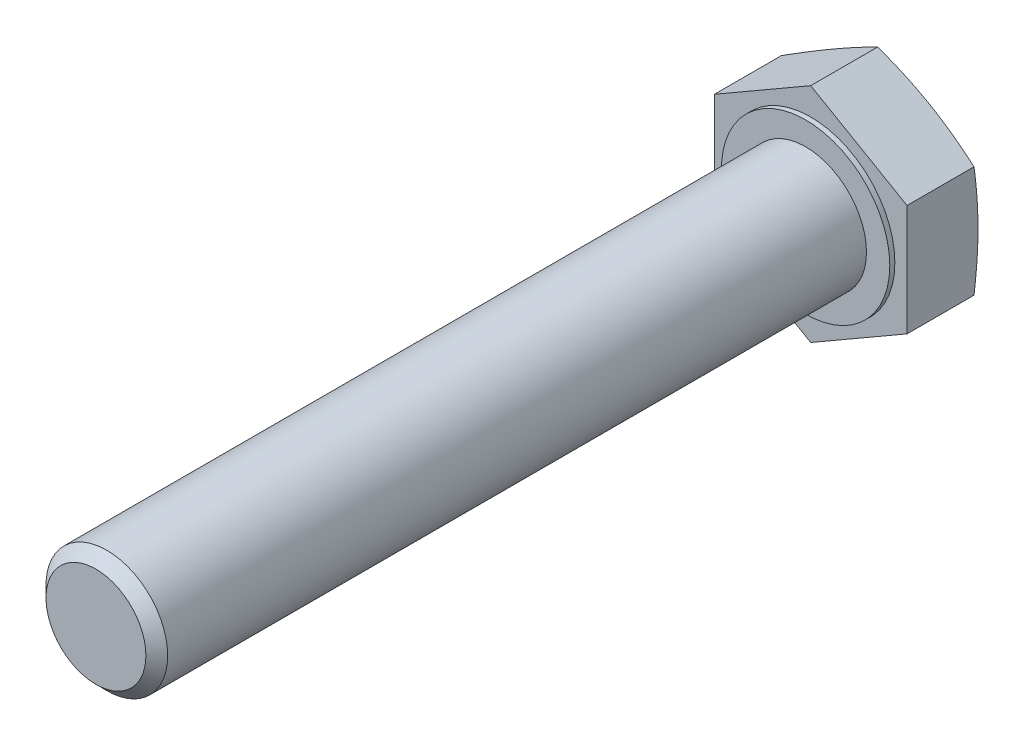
ISO-10303-21;
HEADER;
FILE_DESCRIPTION(('STEP AP214'),'2;1');
FILE_NAME('part.step','',(''),(''),'','','');
FILE_SCHEMA(('AUTOMOTIVE_DESIGN { 1 0 10303 214 1 1 1 1 }'));
ENDSEC;
DATA;
#1=APPLICATION_CONTEXT('core data for automotive mechanical design processes');
#2=APPLICATION_PROTOCOL_DEFINITION('international standard','automotive_design',2000,#1);
#3=PRODUCT_CONTEXT('',#1,'mechanical');
#4=PRODUCT('Part','Part','',(#3));
#5=PRODUCT_RELATED_PRODUCT_CATEGORY('part','',(#4));
#6=PRODUCT_DEFINITION_FORMATION('','',#4);
#7=PRODUCT_DEFINITION_CONTEXT('part definition',#1,'design');
#8=PRODUCT_DEFINITION('design','',#6,#7);
#9=PRODUCT_DEFINITION_SHAPE('','',#8);
#10=(LENGTH_UNIT() NAMED_UNIT(*) SI_UNIT(.MILLI.,.METRE.));
#11=(NAMED_UNIT(*) PLANE_ANGLE_UNIT() SI_UNIT($,.RADIAN.));
#12=(NAMED_UNIT(*) SI_UNIT($,.STERADIAN.) SOLID_ANGLE_UNIT());
#13=UNCERTAINTY_MEASURE_WITH_UNIT(LENGTH_MEASURE(1.E-05),#10,'distance_accuracy_value','');
#14=(GEOMETRIC_REPRESENTATION_CONTEXT(3) GLOBAL_UNCERTAINTY_ASSIGNED_CONTEXT((#13)) GLOBAL_UNIT_ASSIGNED_CONTEXT((#10,
#11,#12)) REPRESENTATION_CONTEXT('',''));
#15=CARTESIAN_POINT('',(0.,0.,0.));
#16=DIRECTION('',(0.,0.,1.));
#17=DIRECTION('',(1.,0.,0.));
#18=AXIS2_PLACEMENT_3D('',#15,#16,#17);
#19=CARTESIAN_POINT('',(0.,-13.5,7.));
#20=DIRECTION('',(0.,0.,1.));
#21=DIRECTION('',(-1.,0.,0.));
#22=AXIS2_PLACEMENT_3D('',#19,#20,#21);
#23=PLANE('',#22);
#24=CARTESIAN_POINT('',(0.,0.,7.));
#25=DIRECTION('',(0.,0.,-1.));
#26=DIRECTION('',(1.,0.,0.));
#27=AXIS2_PLACEMENT_3D('',#24,#25,#26);
#28=CIRCLE('',#27,8.3);
#29=CARTESIAN_POINT('',(8.3,0.,7.));
#30=VERTEX_POINT('',#29);
#31=EDGE_CURVE('E159',#30,#30,#28,.T.);
#32=ORIENTED_EDGE('',*,*,#31,.T.);
#33=EDGE_LOOP('',(#32));
#34=FACE_BOUND('',#33,.T.);
#35=DIRECTION('',(0.,1.,0.));
#36=VECTOR('',#35,1.);
#37=CARTESIAN_POINT('',(9.5,-13.5,7.));
#38=LINE('',#37,#36);
#39=CARTESIAN_POINT('',(9.5,-5.48482755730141,7.));
#40=VERTEX_POINT('',#39);
#41=CARTESIAN_POINT('',(9.5,5.48482755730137,7.));
#42=VERTEX_POINT('',#41);
#43=EDGE_CURVE('E161',#40,#42,#38,.T.);
#44=ORIENTED_EDGE('',*,*,#43,.T.);
#45=DIRECTION('',(-0.866025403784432,0.500000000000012,0.));
#46=VECTOR('',#45,1.);
#47=CARTESIAN_POINT('',(10.5956714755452,4.85224133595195,7.));
#48=LINE('',#47,#46);
#49=CARTESIAN_POINT('',(0.,10.969655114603,7.));
#50=VERTEX_POINT('',#49);
#51=EDGE_CURVE('E9',#42,#50,#48,.T.);
#52=ORIENTED_EDGE('',*,*,#51,.T.);
#53=DIRECTION('',(-0.866025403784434,-0.500000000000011,0.));
#54=VECTOR('',#53,1.);
#55=CARTESIAN_POINT('',(-10.5956714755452,4.852241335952,7.));
#56=LINE('',#55,#54);
#57=CARTESIAN_POINT('',(-9.5,5.48482755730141,7.));
#58=VERTEX_POINT('',#57);
#59=EDGE_CURVE('E22',#50,#58,#56,.T.);
#60=ORIENTED_EDGE('',*,*,#59,.T.);
#61=DIRECTION('',(0.,-1.,0.));
#62=VECTOR('',#61,1.);
#63=CARTESIAN_POINT('',(-9.5,-13.5,7.));
#64=LINE('',#63,#62);
#65=CARTESIAN_POINT('',(-9.5,-5.48482755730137,7.));
#66=VERTEX_POINT('',#65);
#67=EDGE_CURVE('E175',#58,#66,#64,.T.);
#68=ORIENTED_EDGE('',*,*,#67,.T.);
#69=DIRECTION('',(0.866025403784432,-0.500000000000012,0.));
#70=VECTOR('',#69,1.);
#71=CARTESIAN_POINT('',(1.09567147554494,-11.6022413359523,7.));
#72=LINE('',#71,#70);
#73=CARTESIAN_POINT('',(0.,-10.969655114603,7.));
#74=VERTEX_POINT('',#73);
#75=EDGE_CURVE('E167',#66,#74,#72,.T.);
#76=ORIENTED_EDGE('',*,*,#75,.T.);
#77=DIRECTION('',(0.866025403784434,0.500000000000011,0.));
#78=VECTOR('',#77,1.);
#79=CARTESIAN_POINT('',(-1.09567147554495,-11.6022413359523,7.));
#80=LINE('',#79,#78);
#81=EDGE_CURVE('E164',#74,#40,#80,.T.);
#82=ORIENTED_EDGE('',*,*,#81,.T.);
#83=EDGE_LOOP('',(#44,#52,#60,#68,#76,#82));
#84=FACE_BOUND('',#83,.T.);
#85=ADVANCED_FACE('F14',(#34,#84),#23,.T.);
#86=CARTESIAN_POINT('',(0.,0.,77.5));
#87=DIRECTION('',(0.,0.,-1.));
#88=DIRECTION('',(1.,0.,0.));
#89=AXIS2_PLACEMENT_3D('',#86,#87,#88);
#90=CYLINDRICAL_SURFACE('',#89,8.3);
#91=CARTESIAN_POINT('',(0.,0.,7.5));
#92=DIRECTION('',(0.,0.,-1.));
#93=DIRECTION('',(1.,0.,0.));
#94=AXIS2_PLACEMENT_3D('',#91,#92,#93);
#95=CIRCLE('',#94,8.3);
#96=CARTESIAN_POINT('',(8.3,0.,7.5));
#97=VERTEX_POINT('',#96);
#98=EDGE_CURVE('E251',#97,#97,#95,.T.);
#99=ORIENTED_EDGE('',*,*,#98,.T.);
#100=EDGE_LOOP('',(#99));
#101=FACE_BOUND('',#100,.T.);
#102=ORIENTED_EDGE('',*,*,#31,.F.);
#103=EDGE_LOOP('',(#102));
#104=FACE_BOUND('',#103,.T.);
#105=ADVANCED_FACE('F147',(#101,#104),#90,.T.);
#106=CARTESIAN_POINT('',(0.,-8.3,7.5));
#107=DIRECTION('',(0.,0.,1.));
#108=DIRECTION('',(-1.,0.,0.));
#109=AXIS2_PLACEMENT_3D('',#106,#107,#108);
#110=PLANE('',#109);
#111=CARTESIAN_POINT('',(0.,0.,7.5));
#112=DIRECTION('',(0.,0.,-1.));
#113=DIRECTION('',(1.,0.,0.));
#114=AXIS2_PLACEMENT_3D('',#111,#112,#113);
#115=CIRCLE('',#114,6.);
#116=CARTESIAN_POINT('',(6.,0.,7.5));
#117=VERTEX_POINT('',#116);
#118=EDGE_CURVE('E253',#117,#117,#115,.T.);
#119=ORIENTED_EDGE('',*,*,#118,.T.);
#120=EDGE_LOOP('',(#119));
#121=FACE_BOUND('',#120,.T.);
#122=ORIENTED_EDGE('',*,*,#98,.F.);
#123=EDGE_LOOP('',(#122));
#124=FACE_BOUND('',#123,.T.);
#125=ADVANCED_FACE('F143',(#121,#124),#110,.T.);
#126=CARTESIAN_POINT('',(0.,0.,77.5));
#127=DIRECTION('',(0.,0.,-1.));
#128=DIRECTION('',(1.,0.,0.));
#129=AXIS2_PLACEMENT_3D('',#126,#127,#128);
#130=CYLINDRICAL_SURFACE('',#129,6.);
#131=CARTESIAN_POINT('',(0.,0.,76.4265));
#132=DIRECTION('',(0.,0.,-1.));
#133=DIRECTION('',(1.,0.,0.));
#134=AXIS2_PLACEMENT_3D('',#131,#132,#133);
#135=CIRCLE('',#134,6.);
#136=CARTESIAN_POINT('',(6.,0.,76.4265));
#137=VERTEX_POINT('',#136);
#138=EDGE_CURVE('E257',#137,#137,#135,.T.);
#139=ORIENTED_EDGE('',*,*,#138,.T.);
#140=EDGE_LOOP('',(#139));
#141=FACE_BOUND('',#140,.T.);
#142=ORIENTED_EDGE('',*,*,#118,.F.);
#143=EDGE_LOOP('',(#142));
#144=FACE_BOUND('',#143,.T.);
#145=ADVANCED_FACE('F139',(#141,#144),#130,.T.);
#146=CARTESIAN_POINT('',(0.,0.,76.4265));
#147=DIRECTION('',(0.,0.,-1.));
#148=DIRECTION('',(1.,0.,0.));
#149=AXIS2_PLACEMENT_3D('',#146,#147,#148);
#150=CONICAL_SURFACE('',#149,6.,0.785398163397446);
#151=CARTESIAN_POINT('',(0.,0.,77.5));
#152=DIRECTION('',(0.,0.,-1.));
#153=DIRECTION('',(1.,0.,0.));
#154=AXIS2_PLACEMENT_3D('',#151,#152,#153);
#155=CIRCLE('',#154,4.9265);
#156=CARTESIAN_POINT('',(4.9265,0.,77.5));
#157=VERTEX_POINT('',#156);
#158=EDGE_CURVE('E105',#157,#157,#155,.T.);
#159=ORIENTED_EDGE('',*,*,#158,.T.);
#160=EDGE_LOOP('',(#159));
#161=FACE_BOUND('',#160,.T.);
#162=ORIENTED_EDGE('',*,*,#138,.F.);
#163=EDGE_LOOP('',(#162));
#164=FACE_BOUND('',#163,.T.);
#165=ADVANCED_FACE('F135',(#161,#164),#150,.T.);
#166=CARTESIAN_POINT('',(0.,-4.9265,77.5));
#167=DIRECTION('',(0.,0.,1.));
#168=DIRECTION('',(-1.,0.,0.));
#169=AXIS2_PLACEMENT_3D('',#166,#167,#168);
#170=PLANE('',#169);
#171=ORIENTED_EDGE('',*,*,#158,.F.);
#172=EDGE_LOOP('',(#171));
#173=FACE_BOUND('',#172,.T.);
#174=ADVANCED_FACE('F130',(#173),#170,.T.);
#175=CARTESIAN_POINT('',(9.5,5.48482755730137,0.));
#176=DIRECTION('',(0.500000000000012,0.866025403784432,0.));
#177=DIRECTION('',(-0.866025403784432,0.500000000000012,0.));
#178=AXIS2_PLACEMENT_3D('',#175,#176,#177);
#179=PLANE('',#178);
#180=DIRECTION('',(0.,0.,1.));
#181=VECTOR('',#180,1.);
#182=CARTESIAN_POINT('',(0.,10.969655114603,0.));
#183=LINE('',#182,#181);
#184=CARTESIAN_POINT('',(0.,10.969655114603,0.39379290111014));
#185=VERTEX_POINT('',#184);
#186=EDGE_CURVE('E180',#185,#50,#183,.T.);
#187=ORIENTED_EDGE('',*,*,#186,.T.);
#188=ORIENTED_EDGE('',*,*,#51,.F.);
#189=DIRECTION('',(0.,0.,1.));
#190=VECTOR('',#189,1.);
#191=CARTESIAN_POINT('',(9.5,5.48482755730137,0.));
#192=LINE('',#191,#190);
#193=CARTESIAN_POINT('',(9.5,5.48482755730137,0.39379290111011));
#194=VERTEX_POINT('',#193);
#195=EDGE_CURVE('E35',#194,#42,#192,.T.);
#196=ORIENTED_EDGE('',*,*,#195,.F.);
#197=CARTESIAN_POINT('',(-0.000200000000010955,10.9697705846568,0.39382384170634));
#198=CARTESIAN_POINT('',(0.39432772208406,10.7419898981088,0.33276516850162));
#199=CARTESIAN_POINT('',(0.789570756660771,10.5137962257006,0.277334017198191));
#200=CARTESIAN_POINT('',(1.58145262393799,10.0566030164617,0.179946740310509));
#201=CARTESIAN_POINT('',(1.97809195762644,9.82760319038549,0.137996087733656));
#202=CARTESIAN_POINT('',(2.77036165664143,9.37018606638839,0.0700188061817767));
#203=CARTESIAN_POINT('',(3.1659866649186,9.14177186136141,0.0439111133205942));
#204=CARTESIAN_POINT('',(3.95774119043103,8.68465217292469,0.00890337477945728));
#205=CARTESIAN_POINT('',(4.35387059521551,8.45594675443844,0.));
#206=CARTESIAN_POINT('',(5.14612940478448,7.99853591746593,0.));
#207=CARTESIAN_POINT('',(5.54225880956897,7.76983049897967,0.00890337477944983));
#208=CARTESIAN_POINT('',(6.33401333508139,7.31271081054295,0.0439111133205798));
#209=CARTESIAN_POINT('',(6.72963834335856,7.08429660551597,0.070018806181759));
#210=CARTESIAN_POINT('',(7.52190804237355,6.62687948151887,0.137996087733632));
#211=CARTESIAN_POINT('',(7.918547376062,6.39787965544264,0.179946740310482));
#212=CARTESIAN_POINT('',(8.71042924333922,5.94068644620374,0.277334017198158));
#213=CARTESIAN_POINT('',(9.10567227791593,5.71249277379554,0.332765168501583));
#214=CARTESIAN_POINT('',(9.5002,5.48471208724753,0.3938238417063));
#215=B_SPLINE_CURVE_WITH_KNOTS('',3,(#197,#198,#199,#200,#201,#202,#203,#204,#205,#206,#207,
#208,#209,#210,#211,#212,#213,#214),.UNSPECIFIED.,.F.,.F.,(4,2,2,2,2,2,2,2,4),(0.,
1.3789772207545,2.75851359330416,4.130930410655,5.50308163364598,6.87523285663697,
8.2476496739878,9.62718604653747,11.006163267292),.UNSPECIFIED.);
#216=CARTESIAN_POINT('',(4.75000000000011,8.22724133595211,0.));
#217=VERTEX_POINT('',#216);
#218=EDGE_CURVE('E95',#217,#194,#215,.T.);
#219=ORIENTED_EDGE('',*,*,#218,.F.);
#220=EDGE_CURVE('E102',#185,#217,#215,.T.);
#221=ORIENTED_EDGE('',*,*,#220,.F.);
#222=EDGE_LOOP('',(#187,#188,#196,#219,#221));
#223=FACE_BOUND('',#222,.T.);
#224=ADVANCED_FACE('F94',(#223),#179,.T.);
#225=CARTESIAN_POINT('',(0.,10.969655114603,0.));
#226=DIRECTION('',(-0.50000000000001,0.866025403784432,0.));
#227=DIRECTION('',(-0.866025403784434,-0.500000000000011,0.));
#228=AXIS2_PLACEMENT_3D('',#225,#226,#227);
#229=PLANE('',#228);
#230=DIRECTION('',(0.,0.,1.));
#231=VECTOR('',#230,1.);
#232=CARTESIAN_POINT('',(-9.5,5.48482755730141,0.));
#233=LINE('',#232,#231);
#234=CARTESIAN_POINT('',(-9.5,5.48482755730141,0.39379290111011));
#235=VERTEX_POINT('',#234);
#236=EDGE_CURVE('E183',#235,#58,#233,.T.);
#237=ORIENTED_EDGE('',*,*,#236,.T.);
#238=ORIENTED_EDGE('',*,*,#59,.F.);
#239=ORIENTED_EDGE('',*,*,#186,.F.);
#240=CARTESIAN_POINT('',(-9.5002,5.48471208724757,0.39382384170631));
#241=CARTESIAN_POINT('',(-9.10567227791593,5.71249277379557,0.332765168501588));
#242=CARTESIAN_POINT('',(-8.71042924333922,5.94068644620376,0.27733401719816));
#243=CARTESIAN_POINT('',(-7.91854737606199,6.39787965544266,0.179946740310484));
#244=CARTESIAN_POINT('',(-7.52190804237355,6.62687948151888,0.137996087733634));
#245=CARTESIAN_POINT('',(-6.72963834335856,7.08429660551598,0.0700188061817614));
#246=CARTESIAN_POINT('',(-6.33401333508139,7.31271081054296,0.0439111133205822));
#247=CARTESIAN_POINT('',(-5.54225880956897,7.76983049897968,0.00890337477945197));
#248=CARTESIAN_POINT('',(-5.14612940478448,7.99853591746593,0.));
#249=CARTESIAN_POINT('',(-4.35387059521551,8.45594675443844,0.));
#250=CARTESIAN_POINT('',(-3.95774119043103,8.6846521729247,0.00890337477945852));
#251=CARTESIAN_POINT('',(-3.16598666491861,9.14177186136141,0.043911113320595));
#252=CARTESIAN_POINT('',(-2.77036165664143,9.37018606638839,0.0700188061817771));
#253=CARTESIAN_POINT('',(-1.97809195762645,9.82760319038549,0.137996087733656));
#254=CARTESIAN_POINT('',(-1.581452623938,10.0566030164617,0.179946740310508));
#255=CARTESIAN_POINT('',(-0.789570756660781,10.5137962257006,0.277334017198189));
#256=CARTESIAN_POINT('',(-0.394327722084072,10.7419898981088,0.332765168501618));
#257=CARTESIAN_POINT('',(0.000199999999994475,10.9697705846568,0.39382384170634));
#258=B_SPLINE_CURVE_WITH_KNOTS('',3,(#240,#241,#242,#243,#244,#245,#246,#247,#248,#249,#250,
#251,#252,#253,#254,#255,#256,#257),.UNSPECIFIED.,.F.,.F.,(4,2,2,2,2,2,2,2,4),(0.,
1.3789772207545,2.75851359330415,4.13093041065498,5.50308163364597,6.87523285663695,
8.24764967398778,9.62718604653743,11.0061632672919),.UNSPECIFIED.);
#259=CARTESIAN_POINT('',(-4.75000000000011,8.22724133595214,0.));
#260=VERTEX_POINT('',#259);
#261=EDGE_CURVE('E107',#260,#185,#258,.T.);
#262=ORIENTED_EDGE('',*,*,#261,.F.);
#263=EDGE_CURVE('E103',#235,#260,#258,.T.);
#264=ORIENTED_EDGE('',*,*,#263,.F.);
#265=EDGE_LOOP('',(#237,#238,#239,#262,#264));
#266=FACE_BOUND('',#265,.T.);
#267=ADVANCED_FACE('F129',(#266),#229,.T.);
#268=CARTESIAN_POINT('',(-9.5,5.48482755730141,0.));
#269=DIRECTION('',(-1.,0.,0.));
#270=DIRECTION('',(0.,-1.,0.));
#271=AXIS2_PLACEMENT_3D('',#268,#269,#270);
#272=PLANE('',#271);
#273=DIRECTION('',(0.,0.,1.));
#274=VECTOR('',#273,1.);
#275=CARTESIAN_POINT('',(-9.5,-5.48482755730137,0.));
#276=LINE('',#275,#274);
#277=CARTESIAN_POINT('',(-9.5,-5.48482755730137,0.39379290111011));
#278=VERTEX_POINT('',#277);
#279=EDGE_CURVE('E185',#278,#66,#276,.T.);
#280=ORIENTED_EDGE('',*,*,#279,.T.);
#281=ORIENTED_EDGE('',*,*,#67,.F.);
#282=ORIENTED_EDGE('',*,*,#236,.F.);
#283=CARTESIAN_POINT('',(-9.5,14.5499757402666,2.11057152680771));
#284=CARTESIAN_POINT('',(-9.5,14.1185217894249,2.01379629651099));
#285=CARTESIAN_POINT('',(-9.49999999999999,13.6867990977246,1.91819786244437));
#286=CARTESIAN_POINT('',(-9.49999999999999,12.8226841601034,1.72998986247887));
#287=CARTESIAN_POINT('',(-9.49999999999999,12.3902918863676,1.63738042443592));
#288=CARTESIAN_POINT('',(-9.49999999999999,11.5243241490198,1.45570629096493));
#289=CARTESIAN_POINT('',(-9.5,11.090747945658,1.36664510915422));
#290=CARTESIAN_POINT('',(-9.5,10.2226960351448,1.19302231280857));
#291=CARTESIAN_POINT('',(-9.5,9.78822033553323,1.10846066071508));
#292=CARTESIAN_POINT('',(-9.5,8.92167962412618,0.945561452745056));
#293=CARTESIAN_POINT('',(-9.5,8.48962296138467,0.867179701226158));
#294=CARTESIAN_POINT('',(-9.5,7.62432234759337,0.717212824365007));
#295=CARTESIAN_POINT('',(-9.5,7.19107839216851,0.645627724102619));
#296=CARTESIAN_POINT('',(-9.5,6.3233307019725,0.510860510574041));
#297=CARTESIAN_POINT('',(-9.5,5.88882713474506,0.447677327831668));
#298=CARTESIAN_POINT('',(-9.5,5.01843602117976,0.33156739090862));
#299=CARTESIAN_POINT('',(-9.5,4.58254847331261,0.27864064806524));
#300=CARTESIAN_POINT('',(-9.5,3.70445440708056,0.184533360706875));
#301=CARTESIAN_POINT('',(-9.5,3.26223255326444,0.143493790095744));
#302=CARTESIAN_POINT('',(-9.5,2.37666834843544,0.0759866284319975));
#303=CARTESIAN_POINT('',(-9.5,1.9333260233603,0.049518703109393));
#304=CARTESIAN_POINT('',(-9.5,1.0461652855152,0.0126980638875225));
#305=CARTESIAN_POINT('',(-9.5,0.602347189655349,0.00233786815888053));
#306=CARTESIAN_POINT('',(-9.5,-0.285364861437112,-0.00162941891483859));
#307=CARTESIAN_POINT('',(-9.50000000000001,-0.72925881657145,0.0047634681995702));
#308=CARTESIAN_POINT('',(-9.50000000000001,-1.61811955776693,0.0339433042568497));
#309=CARTESIAN_POINT('',(-9.50000000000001,-2.06308434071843,0.0567900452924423));
#310=CARTESIAN_POINT('',(-9.50000000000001,-2.95197284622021,0.117569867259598));
#311=CARTESIAN_POINT('',(-9.50000000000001,-3.39589654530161,0.155503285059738));
#312=CARTESIAN_POINT('',(-9.50000000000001,-4.282698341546,0.244530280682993));
#313=CARTESIAN_POINT('',(-9.50000000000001,-4.7255755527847,0.295632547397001));
#314=CARTESIAN_POINT('',(-9.50000000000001,-5.60990305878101,0.408858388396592));
#315=CARTESIAN_POINT('',(-9.5,-6.05135334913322,0.470981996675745));
#316=CARTESIAN_POINT('',(-9.5,-6.90740744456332,0.600401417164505));
#317=CARTESIAN_POINT('',(-9.50000000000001,-7.32208856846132,0.667190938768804));
#318=CARTESIAN_POINT('',(-9.50000000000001,-8.15034650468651,0.80732930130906));
#319=CARTESIAN_POINT('',(-9.50000000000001,-8.56392328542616,0.88067832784));
#320=CARTESIAN_POINT('',(-9.50000000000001,-9.39013171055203,1.03272743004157));
#321=CARTESIAN_POINT('',(-9.50000000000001,-9.80276325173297,1.11142806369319));
#322=CARTESIAN_POINT('',(-9.50000000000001,-10.6271644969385,1.27318504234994));
#323=CARTESIAN_POINT('',(-9.50000000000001,-11.0389342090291,1.35624134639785));
#324=CARTESIAN_POINT('',(-9.50000000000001,-11.8618399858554,1.52593688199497));
#325=CARTESIAN_POINT('',(-9.50000000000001,-12.2729758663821,1.61257700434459));
#326=CARTESIAN_POINT('',(-9.50000000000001,-13.094619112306,1.78879219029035));
#327=CARTESIAN_POINT('',(-9.50000000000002,-13.5051264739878,1.87836727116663));
#328=CARTESIAN_POINT('',(-9.50000000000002,-14.7357906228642,2.1506960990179));
#329=CARTESIAN_POINT('',(-9.50000000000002,-15.5551469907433,2.33706545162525));
#330=CARTESIAN_POINT('',(-9.50000000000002,-17.184189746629,2.71463208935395));
#331=CARTESIAN_POINT('',(-9.50000000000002,-17.9938915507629,2.90576329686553));
#332=CARTESIAN_POINT('',(-9.50000000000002,-19.6121701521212,3.29278864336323));
#333=CARTESIAN_POINT('',(-9.50000000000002,-20.4207469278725,3.4886828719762));
#334=CARTESIAN_POINT('',(-9.50000000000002,-22.0360159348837,3.88374182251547));
#335=CARTESIAN_POINT('',(-9.50000000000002,-22.842709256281,4.0829020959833));
#336=CARTESIAN_POINT('',(-9.50000000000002,-24.0522379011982,4.38363894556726));
#337=CARTESIAN_POINT('',(-9.50000000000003,-24.4553222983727,4.48421563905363));
#338=CARTESIAN_POINT('',(-9.50000000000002,-25.2613431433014,4.68595832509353));
#339=CARTESIAN_POINT('',(-9.50000000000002,-25.6642795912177,4.78712431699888));
#340=CARTESIAN_POINT('',(-9.5,-26.0671515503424,4.88854645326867));
#341=B_SPLINE_CURVE_WITH_KNOTS('',3,(#283,#284,#285,#286,#287,#288,#289,#290,#291,#292,#293,
#294,#295,#296,#297,#298,#299,#300,#301,#302,#303,#304,#305,#306,#307,#308,#309,#310,#311,#312,
#313,#314,#315,#316,#317,#318,#319,#320,#321,#322,#323,#324,#325,#326,#327,#328,#329,#330,#331,
#332,#333,#334,#335,#336,#337,#338,#339,#340),.UNSPECIFIED.,.F.,.F.,(4,2,2,2,2,2,2,2,2,2,2,2,2,
2,2,2,2,2,2,2,2,2,2,2,2,2,2,2,4),(0.,1.32652772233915,2.65311211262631,3.98097904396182,
5.30883488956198,6.62611833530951,7.94340664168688,9.26052711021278,10.5776490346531,
11.9098053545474,13.2419311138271,14.573437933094,15.9049430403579,17.2413113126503,
18.5777094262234,19.9149915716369,21.2522778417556,22.5122914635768,23.7723407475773,
25.0325216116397,26.2926906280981,27.5531747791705,28.8136663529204,31.3344732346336,
33.830319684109,36.3262131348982,38.8189507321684,40.065278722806,41.3116053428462),.UNSPECIFIED.);
#342=CARTESIAN_POINT('',(-9.5,0.,0.));
#343=VERTEX_POINT('',#342);
#344=EDGE_CURVE('E221',#343,#235,#341,.F.);
#345=ORIENTED_EDGE('',*,*,#344,.F.);
#346=EDGE_CURVE('E227',#278,#343,#341,.F.);
#347=ORIENTED_EDGE('',*,*,#346,.F.);
#348=EDGE_LOOP('',(#280,#281,#282,#345,#347));
#349=FACE_BOUND('',#348,.T.);
#350=ADVANCED_FACE('F215',(#349),#272,.T.);
#351=CARTESIAN_POINT('',(-9.5,-5.48482755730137,0.));
#352=DIRECTION('',(-0.500000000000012,-0.866025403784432,0.));
#353=DIRECTION('',(0.866025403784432,-0.500000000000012,0.));
#354=AXIS2_PLACEMENT_3D('',#351,#352,#353);
#355=PLANE('',#354);
#356=DIRECTION('',(0.,0.,1.));
#357=VECTOR('',#356,1.);
#358=CARTESIAN_POINT('',(0.,-10.969655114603,0.));
#359=LINE('',#358,#357);
#360=CARTESIAN_POINT('',(0.,-10.969655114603,0.393792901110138));
#361=VERTEX_POINT('',#360);
#362=EDGE_CURVE('E596',#361,#74,#359,.T.);
#363=ORIENTED_EDGE('',*,*,#362,.T.);
#364=ORIENTED_EDGE('',*,*,#75,.F.);
#365=ORIENTED_EDGE('',*,*,#279,.F.);
#366=CARTESIAN_POINT('',(0.000200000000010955,-10.9697705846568,0.393823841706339));
#367=CARTESIAN_POINT('',(-0.39432772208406,-10.7419898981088,0.332765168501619));
#368=CARTESIAN_POINT('',(-0.789570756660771,-10.5137962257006,0.277334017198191));
#369=CARTESIAN_POINT('',(-1.581452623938,-10.0566030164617,0.179946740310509));
#370=CARTESIAN_POINT('',(-1.97809195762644,-9.82760319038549,0.137996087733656));
#371=CARTESIAN_POINT('',(-2.77036165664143,-9.37018606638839,0.0700188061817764));
#372=CARTESIAN_POINT('',(-3.1659866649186,-9.14177186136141,0.0439111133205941));
#373=CARTESIAN_POINT('',(-3.95774119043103,-8.68465217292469,0.00890337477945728));
#374=CARTESIAN_POINT('',(-4.35387059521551,-8.45594675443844,0.));
#375=CARTESIAN_POINT('',(-5.14612940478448,-7.99853591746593,0.));
#376=CARTESIAN_POINT('',(-5.54225880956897,-7.76983049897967,0.00890337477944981));
#377=CARTESIAN_POINT('',(-6.33401333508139,-7.31271081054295,0.0439111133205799));
#378=CARTESIAN_POINT('',(-6.72963834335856,-7.08429660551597,0.0700188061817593));
#379=CARTESIAN_POINT('',(-7.52190804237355,-6.62687948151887,0.137996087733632));
#380=CARTESIAN_POINT('',(-7.918547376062,-6.39787965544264,0.179946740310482));
#381=CARTESIAN_POINT('',(-8.71042924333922,-5.94068644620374,0.277334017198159));
#382=CARTESIAN_POINT('',(-9.10567227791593,-5.71249277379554,0.332765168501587));
#383=CARTESIAN_POINT('',(-9.5002,-5.48471208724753,0.39382384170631));
#384=B_SPLINE_CURVE_WITH_KNOTS('',3,(#366,#367,#368,#369,#370,#371,#372,#373,#374,#375,#376,
#377,#378,#379,#380,#381,#382,#383),.UNSPECIFIED.,.F.,.F.,(4,2,2,2,2,2,2,2,4),(0.,
1.3789772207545,2.75851359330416,4.13093041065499,5.50308163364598,6.87523285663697,
8.2476496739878,9.62718604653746,11.006163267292),.UNSPECIFIED.);
#385=CARTESIAN_POINT('',(-4.75000000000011,-8.2272413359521,0.));
#386=VERTEX_POINT('',#385);
#387=EDGE_CURVE('E201',#386,#278,#384,.T.);
#388=ORIENTED_EDGE('',*,*,#387,.F.);
#389=EDGE_CURVE('E228',#361,#386,#384,.T.);
#390=ORIENTED_EDGE('',*,*,#389,.F.);
#391=EDGE_LOOP('',(#363,#364,#365,#388,#390));
#392=FACE_BOUND('',#391,.T.);
#393=ADVANCED_FACE('F210',(#392),#355,.T.);
#394=CARTESIAN_POINT('',(0.,-10.969655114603,0.));
#395=DIRECTION('',(0.50000000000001,-0.866025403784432,0.));
#396=DIRECTION('',(0.866025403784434,0.500000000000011,0.));
#397=AXIS2_PLACEMENT_3D('',#394,#395,#396);
#398=PLANE('',#397);
#399=DIRECTION('',(0.,0.,1.));
#400=VECTOR('',#399,1.);
#401=CARTESIAN_POINT('',(9.5,-5.48482755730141,0.));
#402=LINE('',#401,#400);
#403=CARTESIAN_POINT('',(9.5,-5.48482755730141,0.39379290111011));
#404=VERTEX_POINT('',#403);
#405=EDGE_CURVE('E29',#404,#40,#402,.T.);
#406=ORIENTED_EDGE('',*,*,#405,.T.);
#407=ORIENTED_EDGE('',*,*,#81,.F.);
#408=ORIENTED_EDGE('',*,*,#362,.F.);
#409=CARTESIAN_POINT('',(9.5002,-5.48471208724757,0.3938238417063));
#410=CARTESIAN_POINT('',(9.10567227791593,-5.71249277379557,0.332765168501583));
#411=CARTESIAN_POINT('',(8.71042924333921,-5.94068644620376,0.277334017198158));
#412=CARTESIAN_POINT('',(7.91854737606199,-6.39787965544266,0.179946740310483));
#413=CARTESIAN_POINT('',(7.52190804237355,-6.62687948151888,0.137996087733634));
#414=CARTESIAN_POINT('',(6.72963834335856,-7.08429660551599,0.0700188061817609));
#415=CARTESIAN_POINT('',(6.33401333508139,-7.31271081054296,0.0439111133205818));
#416=CARTESIAN_POINT('',(5.54225880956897,-7.76983049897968,0.0089033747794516));
#417=CARTESIAN_POINT('',(5.14612940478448,-7.99853591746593,0.));
#418=CARTESIAN_POINT('',(4.35387059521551,-8.45594675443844,0.));
#419=CARTESIAN_POINT('',(3.95774119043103,-8.6846521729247,0.00890337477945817));
#420=CARTESIAN_POINT('',(3.16598666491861,-9.14177186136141,0.0439111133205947));
#421=CARTESIAN_POINT('',(2.77036165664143,-9.37018606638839,0.0700188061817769));
#422=CARTESIAN_POINT('',(1.97809195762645,-9.82760319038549,0.137996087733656));
#423=CARTESIAN_POINT('',(1.581452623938,-10.0566030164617,0.179946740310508));
#424=CARTESIAN_POINT('',(0.789570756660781,-10.5137962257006,0.277334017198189));
#425=CARTESIAN_POINT('',(0.394327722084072,-10.7419898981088,0.332765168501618));
#426=CARTESIAN_POINT('',(-0.000199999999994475,-10.9697705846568,0.393823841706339));
#427=B_SPLINE_CURVE_WITH_KNOTS('',3,(#409,#410,#411,#412,#413,#414,#415,#416,#417,#418,#419,
#420,#421,#422,#423,#424,#425,#426),.UNSPECIFIED.,.F.,.F.,(4,2,2,2,2,2,2,2,4),(0.,
1.3789772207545,2.75851359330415,4.13093041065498,5.50308163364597,6.87523285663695,
8.24764967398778,9.62718604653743,11.0061632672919),.UNSPECIFIED.);
#428=CARTESIAN_POINT('',(4.75000000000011,-8.22724133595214,0.));
#429=VERTEX_POINT('',#428);
#430=EDGE_CURVE('E90',#429,#361,#427,.T.);
#431=ORIENTED_EDGE('',*,*,#430,.F.);
#432=EDGE_CURVE('E200',#404,#429,#427,.T.);
#433=ORIENTED_EDGE('',*,*,#432,.F.);
#434=EDGE_LOOP('',(#406,#407,#408,#431,#433));
#435=FACE_BOUND('',#434,.T.);
#436=ADVANCED_FACE('F207',(#435),#398,.T.);
#437=CARTESIAN_POINT('',(9.5,-5.48482755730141,0.));
#438=DIRECTION('',(1.,0.,0.));
#439=DIRECTION('',(0.,1.,0.));
#440=AXIS2_PLACEMENT_3D('',#437,#438,#439);
#441=PLANE('',#440);
#442=ORIENTED_EDGE('',*,*,#195,.T.);
#443=ORIENTED_EDGE('',*,*,#43,.F.);
#444=ORIENTED_EDGE('',*,*,#405,.F.);
#445=CARTESIAN_POINT('',(9.5,14.5499757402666,2.11057152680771));
#446=CARTESIAN_POINT('',(9.50000000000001,14.1185217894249,2.01379629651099));
#447=CARTESIAN_POINT('',(9.50000000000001,13.6867990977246,1.91819786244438));
#448=CARTESIAN_POINT('',(9.50000000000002,12.8226841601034,1.72998986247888));
#449=CARTESIAN_POINT('',(9.50000000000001,12.3902918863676,1.63738042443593));
#450=CARTESIAN_POINT('',(9.50000000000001,11.5243241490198,1.45570629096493));
#451=CARTESIAN_POINT('',(9.50000000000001,11.090747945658,1.36664510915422));
#452=CARTESIAN_POINT('',(9.50000000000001,10.2226960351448,1.19302231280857));
#453=CARTESIAN_POINT('',(9.50000000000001,9.78822033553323,1.10846066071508));
#454=CARTESIAN_POINT('',(9.50000000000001,8.92167962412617,0.945561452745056));
#455=CARTESIAN_POINT('',(9.50000000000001,8.48962296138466,0.867179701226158));
#456=CARTESIAN_POINT('',(9.50000000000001,7.62432234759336,0.717212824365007));
#457=CARTESIAN_POINT('',(9.50000000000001,7.1910783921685,0.645627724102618));
#458=CARTESIAN_POINT('',(9.50000000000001,6.32333070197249,0.510860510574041));
#459=CARTESIAN_POINT('',(9.50000000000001,5.88882713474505,0.447677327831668));
#460=CARTESIAN_POINT('',(9.50000000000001,5.01843602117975,0.33156739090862));
#461=CARTESIAN_POINT('',(9.5,4.5825484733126,0.27864064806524));
#462=CARTESIAN_POINT('',(9.5,3.70445440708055,0.184533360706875));
#463=CARTESIAN_POINT('',(9.50000000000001,3.26223255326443,0.143493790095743));
#464=CARTESIAN_POINT('',(9.50000000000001,2.37666834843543,0.0759866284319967));
#465=CARTESIAN_POINT('',(9.50000000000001,1.93332602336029,0.0495187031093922));
#466=CARTESIAN_POINT('',(9.50000000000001,1.04616528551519,0.0126980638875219));
#467=CARTESIAN_POINT('',(9.50000000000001,0.602347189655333,0.00233786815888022));
#468=CARTESIAN_POINT('',(9.50000000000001,-0.28536486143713,-0.00162941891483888));
#469=CARTESIAN_POINT('',(9.5,-0.729258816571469,0.00476346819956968));
#470=CARTESIAN_POINT('',(9.5,-1.61811955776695,0.0339433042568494));
#471=CARTESIAN_POINT('',(9.5,-2.06308434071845,0.0567900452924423));
#472=CARTESIAN_POINT('',(9.5,-2.95197284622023,0.117569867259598));
#473=CARTESIAN_POINT('',(9.5,-3.39589654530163,0.155503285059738));
#474=CARTESIAN_POINT('',(9.5,-4.28269834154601,0.244530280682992));
#475=CARTESIAN_POINT('',(9.5,-4.72557555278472,0.295632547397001));
#476=CARTESIAN_POINT('',(9.5,-5.60990305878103,0.408858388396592));
#477=CARTESIAN_POINT('',(9.5,-6.05135334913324,0.470981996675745));
#478=CARTESIAN_POINT('',(9.5,-6.90740744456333,0.600401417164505));
#479=CARTESIAN_POINT('',(9.5,-7.32208856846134,0.667190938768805));
#480=CARTESIAN_POINT('',(9.5,-8.15034650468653,0.807329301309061));
#481=CARTESIAN_POINT('',(9.5,-8.56392328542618,0.88067832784));
#482=CARTESIAN_POINT('',(9.5,-9.39013171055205,1.03272743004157));
#483=CARTESIAN_POINT('',(9.5,-9.80276325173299,1.11142806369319));
#484=CARTESIAN_POINT('',(9.5,-10.6271644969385,1.27318504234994));
#485=CARTESIAN_POINT('',(9.49999999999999,-11.0389342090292,1.35624134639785));
#486=CARTESIAN_POINT('',(9.49999999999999,-11.8618399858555,1.52593688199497));
#487=CARTESIAN_POINT('',(9.49999999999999,-12.2729758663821,1.61257700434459));
#488=CARTESIAN_POINT('',(9.49999999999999,-13.094619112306,1.78879219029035));
#489=CARTESIAN_POINT('',(9.49999999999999,-13.5051264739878,1.87836727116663));
#490=CARTESIAN_POINT('',(9.49999999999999,-14.7357906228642,2.1506960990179));
#491=CARTESIAN_POINT('',(9.49999999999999,-15.5551469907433,2.33706545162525));
#492=CARTESIAN_POINT('',(9.49999999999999,-17.184189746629,2.71463208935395));
#493=CARTESIAN_POINT('',(9.49999999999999,-17.9938915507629,2.90576329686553));
#494=CARTESIAN_POINT('',(9.49999999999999,-19.6121701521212,3.29278864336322));
#495=CARTESIAN_POINT('',(9.49999999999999,-20.4207469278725,3.4886828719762));
#496=CARTESIAN_POINT('',(9.49999999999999,-22.0360159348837,3.88374182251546));
#497=CARTESIAN_POINT('',(9.49999999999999,-22.842709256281,4.08290209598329));
#498=CARTESIAN_POINT('',(9.49999999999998,-24.0522379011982,4.38363894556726));
#499=CARTESIAN_POINT('',(9.49999999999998,-24.4553222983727,4.48421563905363));
#500=CARTESIAN_POINT('',(9.49999999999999,-25.2613431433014,4.68595832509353));
#501=CARTESIAN_POINT('',(9.49999999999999,-25.6642795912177,4.78712431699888));
#502=CARTESIAN_POINT('',(9.5,-26.0671515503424,4.88854645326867));
#503=B_SPLINE_CURVE_WITH_KNOTS('',3,(#445,#446,#447,#448,#449,#450,#451,#452,#453,#454,#455,
#456,#457,#458,#459,#460,#461,#462,#463,#464,#465,#466,#467,#468,#469,#470,#471,#472,#473,#474,
#475,#476,#477,#478,#479,#480,#481,#482,#483,#484,#485,#486,#487,#488,#489,#490,#491,#492,#493,
#494,#495,#496,#497,#498,#499,#500,#501,#502),.UNSPECIFIED.,.F.,.F.,(4,2,2,2,2,2,2,2,2,2,2,2,2,
2,2,2,2,2,2,2,2,2,2,2,2,2,2,2,4),(0.,1.32652772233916,2.65311211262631,3.98097904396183,
5.30883488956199,6.62611833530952,7.94340664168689,9.26052711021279,10.5776490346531,
11.9098053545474,13.2419311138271,14.573437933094,15.9049430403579,17.2413113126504,
18.5777094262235,19.914991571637,21.2522778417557,22.5122914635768,23.7723407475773,
25.0325216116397,26.2926906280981,27.5531747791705,28.8136663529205,31.3344732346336,
33.830319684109,36.3262131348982,38.8189507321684,40.065278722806,41.3116053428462),.UNSPECIFIED.);
#504=CARTESIAN_POINT('',(9.5,0.,0.));
#505=VERTEX_POINT('',#504);
#506=EDGE_CURVE('E85',#505,#404,#503,.T.);
#507=ORIENTED_EDGE('',*,*,#506,.F.);
#508=EDGE_CURVE('E82',#194,#505,#503,.T.);
#509=ORIENTED_EDGE('',*,*,#508,.F.);
#510=EDGE_LOOP('',(#442,#443,#444,#507,#509));
#511=FACE_BOUND('',#510,.T.);
#512=ADVANCED_FACE('F83',(#511),#441,.T.);
#513=CARTESIAN_POINT('',(0.,0.,0.));
#514=DIRECTION('',(0.,0.,1.));
#515=DIRECTION('',(-1.,0.,0.));
#516=AXIS2_PLACEMENT_3D('',#513,#514,#515);
#517=CONICAL_SURFACE('',#516,9.5,1.30899693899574);
#518=CARTESIAN_POINT('',(0.,0.,0.));
#519=DIRECTION('',(0.,0.,-1.));
#520=DIRECTION('',(1.,0.,0.));
#521=AXIS2_PLACEMENT_3D('',#518,#519,#520);
#522=CIRCLE('',#521,9.5);
#523=EDGE_CURVE('E100',#217,#505,#522,.T.);
#524=ORIENTED_EDGE('',*,*,#523,.F.);
#525=ORIENTED_EDGE('',*,*,#218,.T.);
#526=ORIENTED_EDGE('',*,*,#508,.T.);
#527=EDGE_LOOP('',(#524,#525,#526));
#528=FACE_BOUND('',#527,.T.);
#529=ADVANCED_FACE('F99',(#528),#517,.T.);
#530=EDGE_CURVE('E249',#260,#217,#522,.T.);
#531=ORIENTED_EDGE('',*,*,#530,.F.);
#532=ORIENTED_EDGE('',*,*,#261,.T.);
#533=ORIENTED_EDGE('',*,*,#220,.T.);
#534=EDGE_LOOP('',(#531,#532,#533));
#535=FACE_BOUND('',#534,.T.);
#536=ADVANCED_FACE('F272',(#535),#517,.T.);
#537=EDGE_CURVE('E250',#343,#260,#522,.T.);
#538=ORIENTED_EDGE('',*,*,#537,.F.);
#539=ORIENTED_EDGE('',*,*,#344,.T.);
#540=ORIENTED_EDGE('',*,*,#263,.T.);
#541=EDGE_LOOP('',(#538,#539,#540));
#542=FACE_BOUND('',#541,.T.);
#543=ADVANCED_FACE('F270',(#542),#517,.T.);
#544=ORIENTED_EDGE('',*,*,#387,.T.);
#545=ORIENTED_EDGE('',*,*,#346,.T.);
#546=EDGE_CURVE('E246',#386,#343,#522,.T.);
#547=ORIENTED_EDGE('',*,*,#546,.F.);
#548=EDGE_LOOP('',(#544,#545,#547));
#549=FACE_BOUND('',#548,.T.);
#550=ADVANCED_FACE('F122',(#549),#517,.T.);
#551=ORIENTED_EDGE('',*,*,#430,.T.);
#552=ORIENTED_EDGE('',*,*,#389,.T.);
#553=EDGE_CURVE('E170',#429,#386,#522,.T.);
#554=ORIENTED_EDGE('',*,*,#553,.F.);
#555=EDGE_LOOP('',(#551,#552,#554));
#556=FACE_BOUND('',#555,.T.);
#557=ADVANCED_FACE('F243',(#556),#517,.T.);
#558=CARTESIAN_POINT('',(0.,0.,0.));
#559=DIRECTION('',(0.,0.,-1.));
#560=DIRECTION('',(1.,0.,0.));
#561=AXIS2_PLACEMENT_3D('',#558,#559,#560);
#562=PLANE('',#561);
#563=EDGE_CURVE('E165',#505,#429,#522,.T.);
#564=ORIENTED_EDGE('',*,*,#563,.T.);
#565=ORIENTED_EDGE('',*,*,#553,.T.);
#566=ORIENTED_EDGE('',*,*,#546,.T.);
#567=ORIENTED_EDGE('',*,*,#537,.T.);
#568=ORIENTED_EDGE('',*,*,#530,.T.);
#569=ORIENTED_EDGE('',*,*,#523,.T.);
#570=EDGE_LOOP('',(#564,#565,#566,#567,#568,#569));
#571=FACE_BOUND('',#570,.T.);
#572=ADVANCED_FACE('F16',(#571),#562,.T.);
#573=ORIENTED_EDGE('',*,*,#506,.T.);
#574=ORIENTED_EDGE('',*,*,#432,.T.);
#575=ORIENTED_EDGE('',*,*,#563,.F.);
#576=EDGE_LOOP('',(#573,#574,#575));
#577=FACE_BOUND('',#576,.T.);
#578=ADVANCED_FACE('F241',(#577),#517,.T.);
#579=CLOSED_SHELL('',(#85,#105,#125,#145,#165,#174,#224,#267,#350,#393,#436,#512,#529,#536,#543,
#550,#557,#572,#578));
#580=MANIFOLD_SOLID_BREP('B1',#579);
#581=ADVANCED_BREP_SHAPE_REPRESENTATION('',(#18,#580),#14);
#582=SHAPE_DEFINITION_REPRESENTATION(#9,#581);
ENDSEC;
END-ISO-10303-21;
